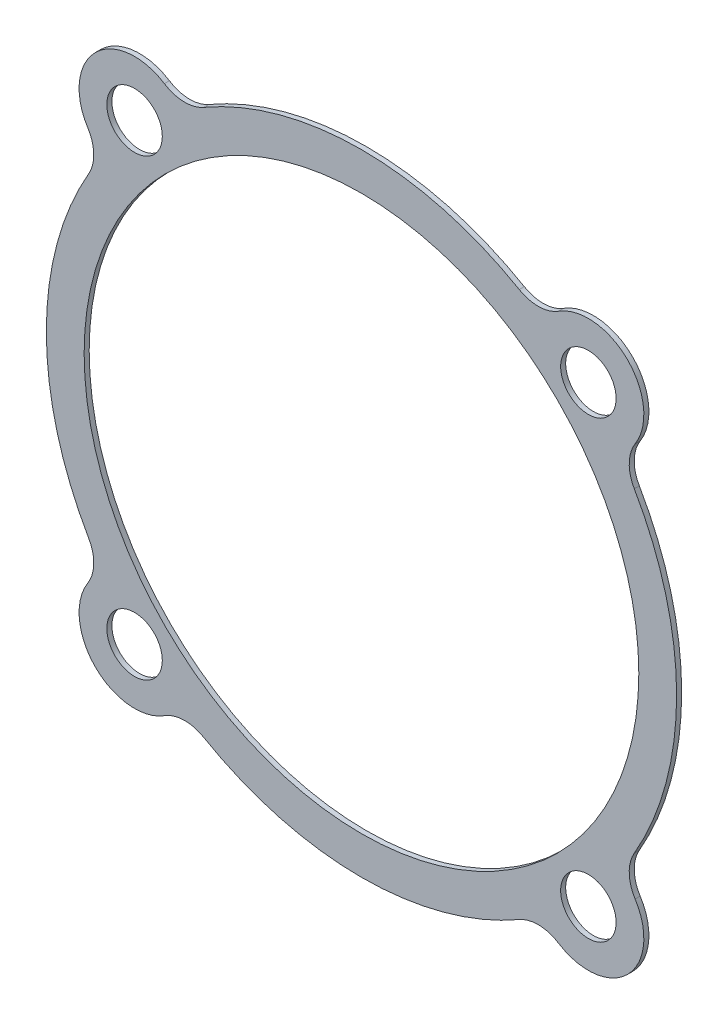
ISO-10303-21;
HEADER;
FILE_DESCRIPTION(('STEP AP214'),'2;1');
FILE_NAME('part.step','',(''),(''),'','','');
FILE_SCHEMA(('AUTOMOTIVE_DESIGN { 1 0 10303 214 1 1 1 1 }'));
ENDSEC;
DATA;
#1=APPLICATION_CONTEXT('core data for automotive mechanical design processes');
#2=APPLICATION_PROTOCOL_DEFINITION('international standard','automotive_design',2000,#1);
#3=PRODUCT_CONTEXT('',#1,'mechanical');
#4=PRODUCT('Part','Part','',(#3));
#5=PRODUCT_RELATED_PRODUCT_CATEGORY('part','',(#4));
#6=PRODUCT_DEFINITION_FORMATION('','',#4);
#7=PRODUCT_DEFINITION_CONTEXT('part definition',#1,'design');
#8=PRODUCT_DEFINITION('design','',#6,#7);
#9=PRODUCT_DEFINITION_SHAPE('','',#8);
#10=(LENGTH_UNIT() NAMED_UNIT(*) SI_UNIT(.MILLI.,.METRE.));
#11=(NAMED_UNIT(*) PLANE_ANGLE_UNIT() SI_UNIT($,.RADIAN.));
#12=(NAMED_UNIT(*) SI_UNIT($,.STERADIAN.) SOLID_ANGLE_UNIT());
#13=UNCERTAINTY_MEASURE_WITH_UNIT(LENGTH_MEASURE(1.E-05),#10,'distance_accuracy_value','');
#14=(GEOMETRIC_REPRESENTATION_CONTEXT(3) GLOBAL_UNCERTAINTY_ASSIGNED_CONTEXT((#13)) GLOBAL_UNIT_ASSIGNED_CONTEXT((#10,
#11,#12)) REPRESENTATION_CONTEXT('',''));
#15=CARTESIAN_POINT('',(0.,0.,0.));
#16=DIRECTION('',(0.,0.,1.));
#17=DIRECTION('',(1.,0.,0.));
#18=AXIS2_PLACEMENT_3D('',#15,#16,#17);
#19=CARTESIAN_POINT('',(-12.118910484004,7.0094228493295,0.));
#20=DIRECTION('',(0.,0.,-1.));
#21=DIRECTION('',(-1.,0.,0.));
#22=AXIS2_PLACEMENT_3D('',#19,#20,#21);
#23=CYLINDRICAL_SURFACE('',#22,1.49999999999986);
#24=CARTESIAN_POINT('',(-12.118910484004,7.0094228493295,-0.2));
#25=DIRECTION('',(0.,0.,1.));
#26=DIRECTION('',(1.,0.,0.));
#27=AXIS2_PLACEMENT_3D('',#24,#25,#26);
#28=CIRCLE('',#27,1.49999999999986);
#29=CARTESIAN_POINT('',(-10.8204557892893,6.25841325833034,-0.2));
#30=VERTEX_POINT('',#29);
#31=CARTESIAN_POINT('',(-10.8544873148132,7.81641358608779,-0.2));
#32=VERTEX_POINT('',#31);
#33=EDGE_CURVE('E462',#30,#32,#28,.T.);
#34=ORIENTED_EDGE('',*,*,#33,.F.);
#35=DIRECTION('',(0.,0.,-1.));
#36=VECTOR('',#35,1.);
#37=CARTESIAN_POINT('',(-10.8204557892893,6.25841325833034,0.));
#38=LINE('',#37,#36);
#39=CARTESIAN_POINT('',(-10.8204557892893,6.25841325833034,0.));
#40=VERTEX_POINT('',#39);
#41=EDGE_CURVE('E11',#40,#30,#38,.T.);
#42=ORIENTED_EDGE('',*,*,#41,.F.);
#43=CARTESIAN_POINT('',(-12.118910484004,7.0094228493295,0.));
#44=DIRECTION('',(0.,0.,1.));
#45=DIRECTION('',(1.,0.,0.));
#46=AXIS2_PLACEMENT_3D('',#43,#44,#45);
#47=CIRCLE('',#46,1.49999999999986);
#48=CARTESIAN_POINT('',(-10.8544873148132,7.81641358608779,0.));
#49=VERTEX_POINT('',#48);
#50=EDGE_CURVE('E464',#40,#49,#47,.T.);
#51=ORIENTED_EDGE('',*,*,#50,.T.);
#52=DIRECTION('',(0.,0.,-1.));
#53=VECTOR('',#52,1.);
#54=CARTESIAN_POINT('',(-10.8544873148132,7.81641358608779,0.));
#55=LINE('',#54,#53);
#56=EDGE_CURVE('E353',#49,#32,#55,.T.);
#57=ORIENTED_EDGE('',*,*,#56,.T.);
#58=EDGE_LOOP('',(#34,#42,#51,#57));
#59=FACE_BOUND('',#58,.T.);
#60=ADVANCED_FACE('F350',(#59),#23,.F.);
#61=CARTESIAN_POINT('',(0.,0.,0.));
#62=DIRECTION('',(0.,0.,-1.));
#63=DIRECTION('',(-1.,0.,0.));
#64=AXIS2_PLACEMENT_3D('',#61,#62,#63);
#65=CYLINDRICAL_SURFACE('',#64,12.5000000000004);
#66=CARTESIAN_POINT('',(0.,0.,-0.2));
#67=DIRECTION('',(0.,0.,-1.));
#68=DIRECTION('',(-1.,0.,0.));
#69=AXIS2_PLACEMENT_3D('',#66,#67,#68);
#70=CIRCLE('',#69,12.5000000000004);
#71=CARTESIAN_POINT('',(-10.8204557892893,-6.25841325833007,-0.2));
#72=VERTEX_POINT('',#71);
#73=EDGE_CURVE('E480',#72,#30,#70,.T.);
#74=ORIENTED_EDGE('',*,*,#73,.F.);
#75=DIRECTION('',(0.,0.,-1.));
#76=VECTOR('',#75,1.);
#77=CARTESIAN_POINT('',(-10.8204557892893,-6.25841325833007,0.));
#78=LINE('',#77,#76);
#79=CARTESIAN_POINT('',(-10.8204557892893,-6.25841325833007,0.));
#80=VERTEX_POINT('',#79);
#81=EDGE_CURVE('E358',#80,#72,#78,.T.);
#82=ORIENTED_EDGE('',*,*,#81,.F.);
#83=CARTESIAN_POINT('',(0.,0.,0.));
#84=DIRECTION('',(0.,0.,-1.));
#85=DIRECTION('',(-1.,0.,0.));
#86=AXIS2_PLACEMENT_3D('',#83,#84,#85);
#87=CIRCLE('',#86,12.5000000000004);
#88=EDGE_CURVE('E469',#80,#40,#87,.T.);
#89=ORIENTED_EDGE('',*,*,#88,.T.);
#90=ORIENTED_EDGE('',*,*,#41,.T.);
#91=EDGE_LOOP('',(#74,#82,#89,#90));
#92=FACE_BOUND('',#91,.T.);
#93=ADVANCED_FACE('F645',(#92),#65,.T.);
#94=CARTESIAN_POINT('',(-12.118910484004,-7.0094228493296,0.));
#95=DIRECTION('',(0.,0.,-1.));
#96=DIRECTION('',(-1.,0.,0.));
#97=AXIS2_PLACEMENT_3D('',#94,#95,#96);
#98=CYLINDRICAL_SURFACE('',#97,1.49999999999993);
#99=CARTESIAN_POINT('',(-12.118910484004,-7.0094228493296,-0.2));
#100=DIRECTION('',(0.,0.,1.));
#101=DIRECTION('',(1.,0.,0.));
#102=AXIS2_PLACEMENT_3D('',#99,#100,#101);
#103=CIRCLE('',#102,1.49999999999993);
#104=CARTESIAN_POINT('',(-10.8544873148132,-7.81641358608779,-0.2));
#105=VERTEX_POINT('',#104);
#106=EDGE_CURVE('E522',#105,#72,#103,.T.);
#107=ORIENTED_EDGE('',*,*,#106,.F.);
#108=DIRECTION('',(0.,0.,-1.));
#109=VECTOR('',#108,1.);
#110=CARTESIAN_POINT('',(-10.8544873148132,-7.81641358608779,0.));
#111=LINE('',#110,#109);
#112=CARTESIAN_POINT('',(-10.8544873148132,-7.81641358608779,0.));
#113=VERTEX_POINT('',#112);
#114=EDGE_CURVE('E568',#113,#105,#111,.T.);
#115=ORIENTED_EDGE('',*,*,#114,.F.);
#116=CARTESIAN_POINT('',(-12.118910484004,-7.0094228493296,0.));
#117=DIRECTION('',(0.,0.,1.));
#118=DIRECTION('',(1.,0.,0.));
#119=AXIS2_PLACEMENT_3D('',#116,#117,#118);
#120=CIRCLE('',#119,1.49999999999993);
#121=EDGE_CURVE('E564',#113,#80,#120,.T.);
#122=ORIENTED_EDGE('',*,*,#121,.T.);
#123=ORIENTED_EDGE('',*,*,#81,.T.);
#124=EDGE_LOOP('',(#107,#115,#122,#123));
#125=FACE_BOUND('',#124,.T.);
#126=ADVANCED_FACE('F641',(#125),#98,.F.);
#127=CARTESIAN_POINT('',(-9.,-9.,0.));
#128=DIRECTION('',(0.,0.,-1.));
#129=DIRECTION('',(-1.,0.,0.));
#130=AXIS2_PLACEMENT_3D('',#127,#128,#129);
#131=CYLINDRICAL_SURFACE('',#130,2.20000000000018);
#132=CARTESIAN_POINT('',(-9.,-9.,-0.2));
#133=DIRECTION('',(0.,0.,-1.));
#134=DIRECTION('',(-1.,0.,0.));
#135=AXIS2_PLACEMENT_3D('',#132,#133,#134);
#136=CIRCLE('',#135,2.20000000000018);
#137=CARTESIAN_POINT('',(-7.81641358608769,-10.8544873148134,-0.2));
#138=VERTEX_POINT('',#137);
#139=EDGE_CURVE('E519',#138,#105,#136,.T.);
#140=ORIENTED_EDGE('',*,*,#139,.F.);
#141=DIRECTION('',(0.,0.,-1.));
#142=VECTOR('',#141,1.);
#143=CARTESIAN_POINT('',(-7.81641358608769,-10.8544873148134,0.));
#144=LINE('',#143,#142);
#145=CARTESIAN_POINT('',(-7.81641358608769,-10.8544873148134,0.));
#146=VERTEX_POINT('',#145);
#147=EDGE_CURVE('E570',#146,#138,#144,.T.);
#148=ORIENTED_EDGE('',*,*,#147,.F.);
#149=CARTESIAN_POINT('',(-9.,-9.,0.));
#150=DIRECTION('',(0.,0.,-1.));
#151=DIRECTION('',(-1.,0.,0.));
#152=AXIS2_PLACEMENT_3D('',#149,#150,#151);
#153=CIRCLE('',#152,2.20000000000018);
#154=EDGE_CURVE('E561',#146,#113,#153,.T.);
#155=ORIENTED_EDGE('',*,*,#154,.T.);
#156=ORIENTED_EDGE('',*,*,#114,.T.);
#157=EDGE_LOOP('',(#140,#148,#155,#156));
#158=FACE_BOUND('',#157,.T.);
#159=ADVANCED_FACE('F637',(#158),#131,.T.);
#160=CARTESIAN_POINT('',(-7.0094228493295,-12.118910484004,0.));
#161=DIRECTION('',(0.,0.,-1.));
#162=DIRECTION('',(-1.,0.,0.));
#163=AXIS2_PLACEMENT_3D('',#160,#161,#162);
#164=CYLINDRICAL_SURFACE('',#163,1.49999999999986);
#165=CARTESIAN_POINT('',(-7.0094228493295,-12.118910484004,-0.2));
#166=DIRECTION('',(0.,0.,1.));
#167=DIRECTION('',(1.,0.,0.));
#168=AXIS2_PLACEMENT_3D('',#165,#166,#167);
#169=CIRCLE('',#168,1.49999999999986);
#170=CARTESIAN_POINT('',(-6.25841325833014,-10.8204557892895,-0.2));
#171=VERTEX_POINT('',#170);
#172=EDGE_CURVE('E516',#171,#138,#169,.T.);
#173=ORIENTED_EDGE('',*,*,#172,.F.);
#174=DIRECTION('',(0.,0.,-1.));
#175=VECTOR('',#174,1.);
#176=CARTESIAN_POINT('',(-6.25841325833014,-10.8204557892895,0.));
#177=LINE('',#176,#175);
#178=CARTESIAN_POINT('',(-6.25841325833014,-10.8204557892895,0.));
#179=VERTEX_POINT('',#178);
#180=EDGE_CURVE('E572',#179,#171,#177,.T.);
#181=ORIENTED_EDGE('',*,*,#180,.F.);
#182=CARTESIAN_POINT('',(-7.0094228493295,-12.118910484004,0.));
#183=DIRECTION('',(0.,0.,1.));
#184=DIRECTION('',(1.,0.,0.));
#185=AXIS2_PLACEMENT_3D('',#182,#183,#184);
#186=CIRCLE('',#185,1.49999999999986);
#187=EDGE_CURVE('E558',#179,#146,#186,.T.);
#188=ORIENTED_EDGE('',*,*,#187,.T.);
#189=ORIENTED_EDGE('',*,*,#147,.T.);
#190=EDGE_LOOP('',(#173,#181,#188,#189));
#191=FACE_BOUND('',#190,.T.);
#192=ADVANCED_FACE('F633',(#191),#164,.F.);
#193=CARTESIAN_POINT('',(0.,0.,0.));
#194=DIRECTION('',(0.,0.,-1.));
#195=DIRECTION('',(-1.,0.,0.));
#196=AXIS2_PLACEMENT_3D('',#193,#194,#195);
#197=CYLINDRICAL_SURFACE('',#196,12.5000000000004);
#198=CARTESIAN_POINT('',(0.,0.,-0.2));
#199=DIRECTION('',(0.,0.,-1.));
#200=DIRECTION('',(-1.,0.,0.));
#201=AXIS2_PLACEMENT_3D('',#198,#199,#200);
#202=CIRCLE('',#201,12.5000000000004);
#203=CARTESIAN_POINT('',(6.25841325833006,-10.8204557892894,-0.2));
#204=VERTEX_POINT('',#203);
#205=EDGE_CURVE('E513',#204,#171,#202,.T.);
#206=ORIENTED_EDGE('',*,*,#205,.F.);
#207=DIRECTION('',(0.,0.,-1.));
#208=VECTOR('',#207,1.);
#209=CARTESIAN_POINT('',(6.25841325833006,-10.8204557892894,0.));
#210=LINE('',#209,#208);
#211=CARTESIAN_POINT('',(6.25841325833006,-10.8204557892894,0.));
#212=VERTEX_POINT('',#211);
#213=EDGE_CURVE('E574',#212,#204,#210,.T.);
#214=ORIENTED_EDGE('',*,*,#213,.F.);
#215=CARTESIAN_POINT('',(0.,0.,0.));
#216=DIRECTION('',(0.,0.,-1.));
#217=DIRECTION('',(-1.,0.,0.));
#218=AXIS2_PLACEMENT_3D('',#215,#216,#217);
#219=CIRCLE('',#218,12.5000000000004);
#220=EDGE_CURVE('E555',#212,#179,#219,.T.);
#221=ORIENTED_EDGE('',*,*,#220,.T.);
#222=ORIENTED_EDGE('',*,*,#180,.T.);
#223=EDGE_LOOP('',(#206,#214,#221,#222));
#224=FACE_BOUND('',#223,.T.);
#225=ADVANCED_FACE('F629',(#224),#197,.T.);
#226=CARTESIAN_POINT('',(7.0094228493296,-12.118910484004,0.));
#227=DIRECTION('',(0.,0.,-1.));
#228=DIRECTION('',(-1.,0.,0.));
#229=AXIS2_PLACEMENT_3D('',#226,#227,#228);
#230=CYLINDRICAL_SURFACE('',#229,1.49999999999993);
#231=CARTESIAN_POINT('',(7.0094228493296,-12.118910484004,-0.2));
#232=DIRECTION('',(0.,0.,1.));
#233=DIRECTION('',(1.,0.,0.));
#234=AXIS2_PLACEMENT_3D('',#231,#232,#233);
#235=CIRCLE('',#234,1.49999999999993);
#236=CARTESIAN_POINT('',(7.81641358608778,-10.8544873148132,-0.2));
#237=VERTEX_POINT('',#236);
#238=EDGE_CURVE('E510',#237,#204,#235,.T.);
#239=ORIENTED_EDGE('',*,*,#238,.F.);
#240=DIRECTION('',(0.,0.,-1.));
#241=VECTOR('',#240,1.);
#242=CARTESIAN_POINT('',(7.81641358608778,-10.8544873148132,0.));
#243=LINE('',#242,#241);
#244=CARTESIAN_POINT('',(7.81641358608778,-10.8544873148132,0.));
#245=VERTEX_POINT('',#244);
#246=EDGE_CURVE('E576',#245,#237,#243,.T.);
#247=ORIENTED_EDGE('',*,*,#246,.F.);
#248=CARTESIAN_POINT('',(7.0094228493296,-12.118910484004,0.));
#249=DIRECTION('',(0.,0.,1.));
#250=DIRECTION('',(1.,0.,0.));
#251=AXIS2_PLACEMENT_3D('',#248,#249,#250);
#252=CIRCLE('',#251,1.49999999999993);
#253=EDGE_CURVE('E552',#245,#212,#252,.T.);
#254=ORIENTED_EDGE('',*,*,#253,.T.);
#255=ORIENTED_EDGE('',*,*,#213,.T.);
#256=EDGE_LOOP('',(#239,#247,#254,#255));
#257=FACE_BOUND('',#256,.T.);
#258=ADVANCED_FACE('F625',(#257),#230,.F.);
#259=CARTESIAN_POINT('',(9.,-9.,0.));
#260=DIRECTION('',(0.,0.,-1.));
#261=DIRECTION('',(-1.,0.,0.));
#262=AXIS2_PLACEMENT_3D('',#259,#260,#261);
#263=CYLINDRICAL_SURFACE('',#262,2.20000000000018);
#264=CARTESIAN_POINT('',(9.,-9.,-0.2));
#265=DIRECTION('',(0.,0.,-1.));
#266=DIRECTION('',(-1.,0.,0.));
#267=AXIS2_PLACEMENT_3D('',#264,#265,#266);
#268=CIRCLE('',#267,2.20000000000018);
#269=CARTESIAN_POINT('',(10.8544873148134,-7.81641358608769,-0.2));
#270=VERTEX_POINT('',#269);
#271=EDGE_CURVE('E507',#270,#237,#268,.T.);
#272=ORIENTED_EDGE('',*,*,#271,.F.);
#273=DIRECTION('',(0.,0.,-1.));
#274=VECTOR('',#273,1.);
#275=CARTESIAN_POINT('',(10.8544873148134,-7.81641358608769,0.));
#276=LINE('',#275,#274);
#277=CARTESIAN_POINT('',(10.8544873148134,-7.81641358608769,0.));
#278=VERTEX_POINT('',#277);
#279=EDGE_CURVE('E578',#278,#270,#276,.T.);
#280=ORIENTED_EDGE('',*,*,#279,.F.);
#281=CARTESIAN_POINT('',(9.,-9.,0.));
#282=DIRECTION('',(0.,0.,-1.));
#283=DIRECTION('',(-1.,0.,0.));
#284=AXIS2_PLACEMENT_3D('',#281,#282,#283);
#285=CIRCLE('',#284,2.20000000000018);
#286=EDGE_CURVE('E549',#278,#245,#285,.T.);
#287=ORIENTED_EDGE('',*,*,#286,.T.);
#288=ORIENTED_EDGE('',*,*,#246,.T.);
#289=EDGE_LOOP('',(#272,#280,#287,#288));
#290=FACE_BOUND('',#289,.T.);
#291=ADVANCED_FACE('F621',(#290),#263,.T.);
#292=CARTESIAN_POINT('',(12.118910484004,-7.0094228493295,0.));
#293=DIRECTION('',(0.,0.,-1.));
#294=DIRECTION('',(-1.,0.,0.));
#295=AXIS2_PLACEMENT_3D('',#292,#293,#294);
#296=CYLINDRICAL_SURFACE('',#295,1.49999999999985);
#297=CARTESIAN_POINT('',(12.118910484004,-7.0094228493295,-0.2));
#298=DIRECTION('',(0.,0.,1.));
#299=DIRECTION('',(1.,0.,0.));
#300=AXIS2_PLACEMENT_3D('',#297,#298,#299);
#301=CIRCLE('',#300,1.49999999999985);
#302=CARTESIAN_POINT('',(10.8204557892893,-6.25841325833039,-0.2));
#303=VERTEX_POINT('',#302);
#304=EDGE_CURVE('E504',#303,#270,#301,.T.);
#305=ORIENTED_EDGE('',*,*,#304,.F.);
#306=DIRECTION('',(0.,0.,-1.));
#307=VECTOR('',#306,1.);
#308=CARTESIAN_POINT('',(10.8204557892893,-6.25841325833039,0.));
#309=LINE('',#308,#307);
#310=CARTESIAN_POINT('',(10.8204557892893,-6.25841325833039,0.));
#311=VERTEX_POINT('',#310);
#312=EDGE_CURVE('E580',#311,#303,#309,.T.);
#313=ORIENTED_EDGE('',*,*,#312,.F.);
#314=CARTESIAN_POINT('',(12.118910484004,-7.0094228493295,0.));
#315=DIRECTION('',(0.,0.,1.));
#316=DIRECTION('',(1.,0.,0.));
#317=AXIS2_PLACEMENT_3D('',#314,#315,#316);
#318=CIRCLE('',#317,1.49999999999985);
#319=EDGE_CURVE('E546',#311,#278,#318,.T.);
#320=ORIENTED_EDGE('',*,*,#319,.T.);
#321=ORIENTED_EDGE('',*,*,#279,.T.);
#322=EDGE_LOOP('',(#305,#313,#320,#321));
#323=FACE_BOUND('',#322,.T.);
#324=ADVANCED_FACE('F617',(#323),#296,.F.);
#325=CARTESIAN_POINT('',(0.,0.,0.));
#326=DIRECTION('',(0.,0.,-1.));
#327=DIRECTION('',(-1.,0.,0.));
#328=AXIS2_PLACEMENT_3D('',#325,#326,#327);
#329=CYLINDRICAL_SURFACE('',#328,12.5000000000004);
#330=CARTESIAN_POINT('',(0.,0.,-0.2));
#331=DIRECTION('',(0.,0.,-1.));
#332=DIRECTION('',(-1.,0.,0.));
#333=AXIS2_PLACEMENT_3D('',#330,#331,#332);
#334=CIRCLE('',#333,12.5000000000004);
#335=CARTESIAN_POINT('',(10.8204557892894,6.2584132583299,-0.2));
#336=VERTEX_POINT('',#335);
#337=EDGE_CURVE('E501',#336,#303,#334,.T.);
#338=ORIENTED_EDGE('',*,*,#337,.F.);
#339=DIRECTION('',(0.,0.,-1.));
#340=VECTOR('',#339,1.);
#341=CARTESIAN_POINT('',(10.8204557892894,6.2584132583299,0.));
#342=LINE('',#341,#340);
#343=CARTESIAN_POINT('',(10.8204557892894,6.2584132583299,0.));
#344=VERTEX_POINT('',#343);
#345=EDGE_CURVE('E582',#344,#336,#342,.T.);
#346=ORIENTED_EDGE('',*,*,#345,.F.);
#347=CARTESIAN_POINT('',(0.,0.,0.));
#348=DIRECTION('',(0.,0.,-1.));
#349=DIRECTION('',(-1.,0.,0.));
#350=AXIS2_PLACEMENT_3D('',#347,#348,#349);
#351=CIRCLE('',#350,12.5000000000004);
#352=EDGE_CURVE('E543',#344,#311,#351,.T.);
#353=ORIENTED_EDGE('',*,*,#352,.T.);
#354=ORIENTED_EDGE('',*,*,#312,.T.);
#355=EDGE_LOOP('',(#338,#346,#353,#354));
#356=FACE_BOUND('',#355,.T.);
#357=ADVANCED_FACE('F613',(#356),#329,.T.);
#358=CARTESIAN_POINT('',(12.118910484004,7.0094228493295,0.));
#359=DIRECTION('',(0.,0.,-1.));
#360=DIRECTION('',(-1.,0.,0.));
#361=AXIS2_PLACEMENT_3D('',#358,#359,#360);
#362=CYLINDRICAL_SURFACE('',#361,1.49999999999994);
#363=CARTESIAN_POINT('',(12.118910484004,7.0094228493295,-0.2));
#364=DIRECTION('',(0.,0.,1.));
#365=DIRECTION('',(1.,0.,0.));
#366=AXIS2_PLACEMENT_3D('',#363,#364,#365);
#367=CIRCLE('',#366,1.49999999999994);
#368=CARTESIAN_POINT('',(10.8544873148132,7.81641358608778,-0.2));
#369=VERTEX_POINT('',#368);
#370=EDGE_CURVE('E498',#369,#336,#367,.T.);
#371=ORIENTED_EDGE('',*,*,#370,.F.);
#372=DIRECTION('',(0.,0.,-1.));
#373=VECTOR('',#372,1.);
#374=CARTESIAN_POINT('',(10.8544873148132,7.81641358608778,0.));
#375=LINE('',#374,#373);
#376=CARTESIAN_POINT('',(10.8544873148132,7.81641358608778,0.));
#377=VERTEX_POINT('',#376);
#378=EDGE_CURVE('E584',#377,#369,#375,.T.);
#379=ORIENTED_EDGE('',*,*,#378,.F.);
#380=CARTESIAN_POINT('',(12.118910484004,7.0094228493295,0.));
#381=DIRECTION('',(0.,0.,1.));
#382=DIRECTION('',(1.,0.,0.));
#383=AXIS2_PLACEMENT_3D('',#380,#381,#382);
#384=CIRCLE('',#383,1.49999999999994);
#385=EDGE_CURVE('E540',#377,#344,#384,.T.);
#386=ORIENTED_EDGE('',*,*,#385,.T.);
#387=ORIENTED_EDGE('',*,*,#345,.T.);
#388=EDGE_LOOP('',(#371,#379,#386,#387));
#389=FACE_BOUND('',#388,.T.);
#390=ADVANCED_FACE('F609',(#389),#362,.F.);
#391=CARTESIAN_POINT('',(9.,9.,0.));
#392=DIRECTION('',(0.,0.,-1.));
#393=DIRECTION('',(-1.,0.,0.));
#394=AXIS2_PLACEMENT_3D('',#391,#392,#393);
#395=CYLINDRICAL_SURFACE('',#394,2.20000000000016);
#396=CARTESIAN_POINT('',(9.,9.,-0.2));
#397=DIRECTION('',(0.,0.,-1.));
#398=DIRECTION('',(-1.,0.,0.));
#399=AXIS2_PLACEMENT_3D('',#396,#397,#398);
#400=CIRCLE('',#399,2.20000000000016);
#401=CARTESIAN_POINT('',(7.81641358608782,10.8544873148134,-0.2));
#402=VERTEX_POINT('',#401);
#403=EDGE_CURVE('E495',#402,#369,#400,.T.);
#404=ORIENTED_EDGE('',*,*,#403,.F.);
#405=DIRECTION('',(0.,0.,-1.));
#406=VECTOR('',#405,1.);
#407=CARTESIAN_POINT('',(7.81641358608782,10.8544873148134,0.));
#408=LINE('',#407,#406);
#409=CARTESIAN_POINT('',(7.81641358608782,10.8544873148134,0.));
#410=VERTEX_POINT('',#409);
#411=EDGE_CURVE('E586',#410,#402,#408,.T.);
#412=ORIENTED_EDGE('',*,*,#411,.F.);
#413=CARTESIAN_POINT('',(9.,9.,0.));
#414=DIRECTION('',(0.,0.,-1.));
#415=DIRECTION('',(-1.,0.,0.));
#416=AXIS2_PLACEMENT_3D('',#413,#414,#415);
#417=CIRCLE('',#416,2.20000000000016);
#418=EDGE_CURVE('E537',#410,#377,#417,.T.);
#419=ORIENTED_EDGE('',*,*,#418,.T.);
#420=ORIENTED_EDGE('',*,*,#378,.T.);
#421=EDGE_LOOP('',(#404,#412,#419,#420));
#422=FACE_BOUND('',#421,.T.);
#423=ADVANCED_FACE('F605',(#422),#395,.T.);
#424=CARTESIAN_POINT('',(7.0094228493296,12.118910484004,0.));
#425=DIRECTION('',(0.,0.,-1.));
#426=DIRECTION('',(-1.,0.,0.));
#427=AXIS2_PLACEMENT_3D('',#424,#425,#426);
#428=CYLINDRICAL_SURFACE('',#427,1.49999999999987);
#429=CARTESIAN_POINT('',(7.0094228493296,12.118910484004,-0.2));
#430=DIRECTION('',(0.,0.,1.));
#431=DIRECTION('',(1.,0.,0.));
#432=AXIS2_PLACEMENT_3D('',#429,#430,#431);
#433=CIRCLE('',#432,1.49999999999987);
#434=CARTESIAN_POINT('',(6.2584132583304,10.8204557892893,-0.2));
#435=VERTEX_POINT('',#434);
#436=EDGE_CURVE('E492',#435,#402,#433,.T.);
#437=ORIENTED_EDGE('',*,*,#436,.F.);
#438=DIRECTION('',(0.,0.,-1.));
#439=VECTOR('',#438,1.);
#440=CARTESIAN_POINT('',(6.2584132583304,10.8204557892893,0.));
#441=LINE('',#440,#439);
#442=CARTESIAN_POINT('',(6.2584132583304,10.8204557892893,0.));
#443=VERTEX_POINT('',#442);
#444=EDGE_CURVE('E588',#443,#435,#441,.T.);
#445=ORIENTED_EDGE('',*,*,#444,.F.);
#446=CARTESIAN_POINT('',(7.0094228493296,12.118910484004,0.));
#447=DIRECTION('',(0.,0.,1.));
#448=DIRECTION('',(1.,0.,0.));
#449=AXIS2_PLACEMENT_3D('',#446,#447,#448);
#450=CIRCLE('',#449,1.49999999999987);
#451=EDGE_CURVE('E534',#443,#410,#450,.T.);
#452=ORIENTED_EDGE('',*,*,#451,.T.);
#453=ORIENTED_EDGE('',*,*,#411,.T.);
#454=EDGE_LOOP('',(#437,#445,#452,#453));
#455=FACE_BOUND('',#454,.T.);
#456=ADVANCED_FACE('F601',(#455),#428,.F.);
#457=CARTESIAN_POINT('',(0.,0.,0.));
#458=DIRECTION('',(0.,0.,-1.));
#459=DIRECTION('',(-1.,0.,0.));
#460=AXIS2_PLACEMENT_3D('',#457,#458,#459);
#461=CYLINDRICAL_SURFACE('',#460,12.5000000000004);
#462=CARTESIAN_POINT('',(0.,0.,-0.2));
#463=DIRECTION('',(0.,0.,-1.));
#464=DIRECTION('',(-1.,0.,0.));
#465=AXIS2_PLACEMENT_3D('',#462,#463,#464);
#466=CIRCLE('',#465,12.5000000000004);
#467=CARTESIAN_POINT('',(-6.25841325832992,10.8204557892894,-0.2));
#468=VERTEX_POINT('',#467);
#469=EDGE_CURVE('E489',#468,#435,#466,.T.);
#470=ORIENTED_EDGE('',*,*,#469,.F.);
#471=DIRECTION('',(0.,0.,-1.));
#472=VECTOR('',#471,1.);
#473=CARTESIAN_POINT('',(-6.25841325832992,10.8204557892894,0.));
#474=LINE('',#473,#472);
#475=CARTESIAN_POINT('',(-6.25841325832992,10.8204557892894,0.));
#476=VERTEX_POINT('',#475);
#477=EDGE_CURVE('E590',#476,#468,#474,.T.);
#478=ORIENTED_EDGE('',*,*,#477,.F.);
#479=CARTESIAN_POINT('',(0.,0.,0.));
#480=DIRECTION('',(0.,0.,-1.));
#481=DIRECTION('',(-1.,0.,0.));
#482=AXIS2_PLACEMENT_3D('',#479,#480,#481);
#483=CIRCLE('',#482,12.5000000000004);
#484=EDGE_CURVE('E531',#476,#443,#483,.T.);
#485=ORIENTED_EDGE('',*,*,#484,.T.);
#486=ORIENTED_EDGE('',*,*,#444,.T.);
#487=EDGE_LOOP('',(#470,#478,#485,#486));
#488=FACE_BOUND('',#487,.T.);
#489=ADVANCED_FACE('F597',(#488),#461,.T.);
#490=CARTESIAN_POINT('',(-7.0094228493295,12.118910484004,0.));
#491=DIRECTION('',(0.,0.,-1.));
#492=DIRECTION('',(-1.,0.,0.));
#493=AXIS2_PLACEMENT_3D('',#490,#491,#492);
#494=CYLINDRICAL_SURFACE('',#493,1.49999999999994);
#495=CARTESIAN_POINT('',(-7.0094228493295,12.118910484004,-0.2));
#496=DIRECTION('',(0.,0.,1.));
#497=DIRECTION('',(1.,0.,0.));
#498=AXIS2_PLACEMENT_3D('',#495,#496,#497);
#499=CIRCLE('',#498,1.49999999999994);
#500=CARTESIAN_POINT('',(-7.81641358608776,10.8544873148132,-0.2));
#501=VERTEX_POINT('',#500);
#502=EDGE_CURVE('E476',#501,#468,#499,.T.);
#503=ORIENTED_EDGE('',*,*,#502,.F.);
#504=DIRECTION('',(0.,0.,-1.));
#505=VECTOR('',#504,1.);
#506=CARTESIAN_POINT('',(-7.81641358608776,10.8544873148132,0.));
#507=LINE('',#506,#505);
#508=CARTESIAN_POINT('',(-7.81641358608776,10.8544873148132,0.));
#509=VERTEX_POINT('',#508);
#510=EDGE_CURVE('E468',#509,#501,#507,.T.);
#511=ORIENTED_EDGE('',*,*,#510,.F.);
#512=CARTESIAN_POINT('',(-7.0094228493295,12.118910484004,0.));
#513=DIRECTION('',(0.,0.,1.));
#514=DIRECTION('',(1.,0.,0.));
#515=AXIS2_PLACEMENT_3D('',#512,#513,#514);
#516=CIRCLE('',#515,1.49999999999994);
#517=EDGE_CURVE('E528',#509,#476,#516,.T.);
#518=ORIENTED_EDGE('',*,*,#517,.T.);
#519=ORIENTED_EDGE('',*,*,#477,.T.);
#520=EDGE_LOOP('',(#503,#511,#518,#519));
#521=FACE_BOUND('',#520,.T.);
#522=ADVANCED_FACE('F593',(#521),#494,.F.);
#523=CARTESIAN_POINT('',(-9.,9.,0.));
#524=DIRECTION('',(0.,0.,-1.));
#525=DIRECTION('',(-1.,0.,0.));
#526=AXIS2_PLACEMENT_3D('',#523,#524,#525);
#527=CYLINDRICAL_SURFACE('',#526,2.20000000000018);
#528=CARTESIAN_POINT('',(-9.,9.,-0.2));
#529=DIRECTION('',(0.,0.,-1.));
#530=DIRECTION('',(-1.,0.,0.));
#531=AXIS2_PLACEMENT_3D('',#528,#529,#530);
#532=CIRCLE('',#531,2.20000000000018);
#533=EDGE_CURVE('E471',#32,#501,#532,.T.);
#534=ORIENTED_EDGE('',*,*,#533,.F.);
#535=ORIENTED_EDGE('',*,*,#56,.F.);
#536=CARTESIAN_POINT('',(-9.,9.,0.));
#537=DIRECTION('',(0.,0.,-1.));
#538=DIRECTION('',(-1.,0.,0.));
#539=AXIS2_PLACEMENT_3D('',#536,#537,#538);
#540=CIRCLE('',#539,2.20000000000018);
#541=EDGE_CURVE('E526',#49,#509,#540,.T.);
#542=ORIENTED_EDGE('',*,*,#541,.T.);
#543=ORIENTED_EDGE('',*,*,#510,.T.);
#544=EDGE_LOOP('',(#534,#535,#542,#543));
#545=FACE_BOUND('',#544,.T.);
#546=ADVANCED_FACE('F472',(#545),#527,.T.);
#547=CARTESIAN_POINT('',(-10.559455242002,8.00471142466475,0.));
#548=DIRECTION('',(0.,0.,1.));
#549=DIRECTION('',(1.,0.,0.));
#550=AXIS2_PLACEMENT_3D('',#547,#548,#549);
#551=PLANE('',#550);
#552=CARTESIAN_POINT('',(0.,0.,0.));
#553=DIRECTION('',(0.,0.,-1.));
#554=DIRECTION('',(1.,0.,0.));
#555=AXIS2_PLACEMENT_3D('',#552,#553,#554);
#556=CIRCLE('',#555,11.);
#557=CARTESIAN_POINT('',(11.,0.,0.));
#558=VERTEX_POINT('',#557);
#559=EDGE_CURVE('E692',#558,#558,#556,.T.);
#560=ORIENTED_EDGE('',*,*,#559,.T.);
#561=EDGE_LOOP('',(#560));
#562=FACE_BOUND('',#561,.T.);
#563=CARTESIAN_POINT('',(9.,9.,0.));
#564=DIRECTION('',(0.,0.,-1.));
#565=DIRECTION('',(1.,0.,0.));
#566=AXIS2_PLACEMENT_3D('',#563,#564,#565);
#567=CIRCLE('',#566,1.10000000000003);
#568=CARTESIAN_POINT('',(10.1,9.,0.));
#569=VERTEX_POINT('',#568);
#570=EDGE_CURVE('E696',#569,#569,#567,.T.);
#571=ORIENTED_EDGE('',*,*,#570,.T.);
#572=EDGE_LOOP('',(#571));
#573=FACE_BOUND('',#572,.T.);
#574=CARTESIAN_POINT('',(-9.,9.,0.));
#575=DIRECTION('',(0.,0.,-1.));
#576=DIRECTION('',(1.,0.,0.));
#577=AXIS2_PLACEMENT_3D('',#574,#575,#576);
#578=CIRCLE('',#577,1.10000000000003);
#579=CARTESIAN_POINT('',(-7.89999999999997,9.,0.));
#580=VERTEX_POINT('',#579);
#581=EDGE_CURVE('E700',#580,#580,#578,.T.);
#582=ORIENTED_EDGE('',*,*,#581,.T.);
#583=EDGE_LOOP('',(#582));
#584=FACE_BOUND('',#583,.T.);
#585=CARTESIAN_POINT('',(9.,-9.,0.));
#586=DIRECTION('',(0.,0.,-1.));
#587=DIRECTION('',(1.,0.,0.));
#588=AXIS2_PLACEMENT_3D('',#585,#586,#587);
#589=CIRCLE('',#588,1.10000000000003);
#590=CARTESIAN_POINT('',(10.1,-9.,0.));
#591=VERTEX_POINT('',#590);
#592=EDGE_CURVE('E704',#591,#591,#589,.T.);
#593=ORIENTED_EDGE('',*,*,#592,.T.);
#594=EDGE_LOOP('',(#593));
#595=FACE_BOUND('',#594,.T.);
#596=CARTESIAN_POINT('',(-9.,-9.,0.));
#597=DIRECTION('',(0.,0.,-1.));
#598=DIRECTION('',(1.,0.,0.));
#599=AXIS2_PLACEMENT_3D('',#596,#597,#598);
#600=CIRCLE('',#599,1.10000000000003);
#601=CARTESIAN_POINT('',(-7.89999999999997,-9.,0.));
#602=VERTEX_POINT('',#601);
#603=EDGE_CURVE('E481',#602,#602,#600,.T.);
#604=ORIENTED_EDGE('',*,*,#603,.T.);
#605=EDGE_LOOP('',(#604));
#606=FACE_BOUND('',#605,.T.);
#607=ORIENTED_EDGE('',*,*,#50,.F.);
#608=ORIENTED_EDGE('',*,*,#88,.F.);
#609=ORIENTED_EDGE('',*,*,#121,.F.);
#610=ORIENTED_EDGE('',*,*,#154,.F.);
#611=ORIENTED_EDGE('',*,*,#187,.F.);
#612=ORIENTED_EDGE('',*,*,#220,.F.);
#613=ORIENTED_EDGE('',*,*,#253,.F.);
#614=ORIENTED_EDGE('',*,*,#286,.F.);
#615=ORIENTED_EDGE('',*,*,#319,.F.);
#616=ORIENTED_EDGE('',*,*,#352,.F.);
#617=ORIENTED_EDGE('',*,*,#385,.F.);
#618=ORIENTED_EDGE('',*,*,#418,.F.);
#619=ORIENTED_EDGE('',*,*,#451,.F.);
#620=ORIENTED_EDGE('',*,*,#484,.F.);
#621=ORIENTED_EDGE('',*,*,#517,.F.);
#622=ORIENTED_EDGE('',*,*,#541,.F.);
#623=EDGE_LOOP('',(#607,#608,#609,#610,#611,#612,#613,#614,#615,#616,#617,#618,#619,#620,#621,#622));
#624=FACE_BOUND('',#623,.T.);
#625=ADVANCED_FACE('F644',(#562,#573,#584,#595,#606,#624),#551,.T.);
#626=CARTESIAN_POINT('',(-10.559455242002,8.00471142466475,-0.2));
#627=DIRECTION('',(0.,0.,1.));
#628=DIRECTION('',(1.,0.,0.));
#629=AXIS2_PLACEMENT_3D('',#626,#627,#628);
#630=PLANE('',#629);
#631=CARTESIAN_POINT('',(0.,0.,-0.2));
#632=DIRECTION('',(0.,0.,-1.));
#633=DIRECTION('',(1.,0.,0.));
#634=AXIS2_PLACEMENT_3D('',#631,#632,#633);
#635=CIRCLE('',#634,11.);
#636=CARTESIAN_POINT('',(11.,0.,-0.2));
#637=VERTEX_POINT('',#636);
#638=EDGE_CURVE('E728',#637,#637,#635,.T.);
#639=ORIENTED_EDGE('',*,*,#638,.F.);
#640=EDGE_LOOP('',(#639));
#641=FACE_BOUND('',#640,.T.);
#642=CARTESIAN_POINT('',(9.,9.,-0.2));
#643=DIRECTION('',(0.,0.,-1.));
#644=DIRECTION('',(1.,0.,0.));
#645=AXIS2_PLACEMENT_3D('',#642,#643,#644);
#646=CIRCLE('',#645,1.10000000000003);
#647=CARTESIAN_POINT('',(10.1,9.,-0.2));
#648=VERTEX_POINT('',#647);
#649=EDGE_CURVE('E724',#648,#648,#646,.T.);
#650=ORIENTED_EDGE('',*,*,#649,.F.);
#651=EDGE_LOOP('',(#650));
#652=FACE_BOUND('',#651,.T.);
#653=CARTESIAN_POINT('',(-9.,9.,-0.2));
#654=DIRECTION('',(0.,0.,-1.));
#655=DIRECTION('',(1.,0.,0.));
#656=AXIS2_PLACEMENT_3D('',#653,#654,#655);
#657=CIRCLE('',#656,1.10000000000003);
#658=CARTESIAN_POINT('',(-7.89999999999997,9.,-0.2));
#659=VERTEX_POINT('',#658);
#660=EDGE_CURVE('E720',#659,#659,#657,.T.);
#661=ORIENTED_EDGE('',*,*,#660,.F.);
#662=EDGE_LOOP('',(#661));
#663=FACE_BOUND('',#662,.T.);
#664=CARTESIAN_POINT('',(9.,-9.,-0.2));
#665=DIRECTION('',(0.,0.,-1.));
#666=DIRECTION('',(1.,0.,0.));
#667=AXIS2_PLACEMENT_3D('',#664,#665,#666);
#668=CIRCLE('',#667,1.10000000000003);
#669=CARTESIAN_POINT('',(10.1,-9.,-0.2));
#670=VERTEX_POINT('',#669);
#671=EDGE_CURVE('E714',#670,#670,#668,.T.);
#672=ORIENTED_EDGE('',*,*,#671,.F.);
#673=EDGE_LOOP('',(#672));
#674=FACE_BOUND('',#673,.T.);
#675=CARTESIAN_POINT('',(-9.,-9.,-0.2));
#676=DIRECTION('',(0.,0.,-1.));
#677=DIRECTION('',(1.,0.,0.));
#678=AXIS2_PLACEMENT_3D('',#675,#676,#677);
#679=CIRCLE('',#678,1.10000000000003);
#680=CARTESIAN_POINT('',(-7.89999999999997,-9.,-0.2));
#681=VERTEX_POINT('',#680);
#682=EDGE_CURVE('E484',#681,#681,#679,.T.);
#683=ORIENTED_EDGE('',*,*,#682,.F.);
#684=EDGE_LOOP('',(#683));
#685=FACE_BOUND('',#684,.T.);
#686=ORIENTED_EDGE('',*,*,#33,.T.);
#687=ORIENTED_EDGE('',*,*,#533,.T.);
#688=ORIENTED_EDGE('',*,*,#502,.T.);
#689=ORIENTED_EDGE('',*,*,#469,.T.);
#690=ORIENTED_EDGE('',*,*,#436,.T.);
#691=ORIENTED_EDGE('',*,*,#403,.T.);
#692=ORIENTED_EDGE('',*,*,#370,.T.);
#693=ORIENTED_EDGE('',*,*,#337,.T.);
#694=ORIENTED_EDGE('',*,*,#304,.T.);
#695=ORIENTED_EDGE('',*,*,#271,.T.);
#696=ORIENTED_EDGE('',*,*,#238,.T.);
#697=ORIENTED_EDGE('',*,*,#205,.T.);
#698=ORIENTED_EDGE('',*,*,#172,.T.);
#699=ORIENTED_EDGE('',*,*,#139,.T.);
#700=ORIENTED_EDGE('',*,*,#106,.T.);
#701=ORIENTED_EDGE('',*,*,#73,.T.);
#702=EDGE_LOOP('',(#686,#687,#688,#689,#690,#691,#692,#693,#694,#695,#696,#697,#698,#699,#700,#701));
#703=FACE_BOUND('',#702,.T.);
#704=ADVANCED_FACE('F478',(#641,#652,#663,#674,#685,#703),#630,.F.);
#705=CARTESIAN_POINT('',(-9.,-9.,0.));
#706=DIRECTION('',(0.,0.,-1.));
#707=DIRECTION('',(-1.,0.,0.));
#708=AXIS2_PLACEMENT_3D('',#705,#706,#707);
#709=CYLINDRICAL_SURFACE('',#708,1.10000000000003);
#710=ORIENTED_EDGE('',*,*,#603,.F.);
#711=EDGE_LOOP('',(#710));
#712=FACE_BOUND('',#711,.T.);
#713=ORIENTED_EDGE('',*,*,#682,.T.);
#714=EDGE_LOOP('',(#713));
#715=FACE_BOUND('',#714,.T.);
#716=ADVANCED_FACE('F687',(#712,#715),#709,.F.);
#717=CARTESIAN_POINT('',(9.,-9.,0.));
#718=DIRECTION('',(0.,0.,-1.));
#719=DIRECTION('',(-1.,0.,0.));
#720=AXIS2_PLACEMENT_3D('',#717,#718,#719);
#721=CYLINDRICAL_SURFACE('',#720,1.10000000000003);
#722=ORIENTED_EDGE('',*,*,#592,.F.);
#723=EDGE_LOOP('',(#722));
#724=FACE_BOUND('',#723,.T.);
#725=ORIENTED_EDGE('',*,*,#671,.T.);
#726=EDGE_LOOP('',(#725));
#727=FACE_BOUND('',#726,.T.);
#728=ADVANCED_FACE('F709',(#724,#727),#721,.F.);
#729=CARTESIAN_POINT('',(-9.,9.,0.));
#730=DIRECTION('',(0.,0.,-1.));
#731=DIRECTION('',(-1.,0.,0.));
#732=AXIS2_PLACEMENT_3D('',#729,#730,#731);
#733=CYLINDRICAL_SURFACE('',#732,1.10000000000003);
#734=ORIENTED_EDGE('',*,*,#581,.F.);
#735=EDGE_LOOP('',(#734));
#736=FACE_BOUND('',#735,.T.);
#737=ORIENTED_EDGE('',*,*,#660,.T.);
#738=EDGE_LOOP('',(#737));
#739=FACE_BOUND('',#738,.T.);
#740=ADVANCED_FACE('F741',(#736,#739),#733,.F.);
#741=CARTESIAN_POINT('',(9.,9.,0.));
#742=DIRECTION('',(0.,0.,-1.));
#743=DIRECTION('',(-1.,0.,0.));
#744=AXIS2_PLACEMENT_3D('',#741,#742,#743);
#745=CYLINDRICAL_SURFACE('',#744,1.10000000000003);
#746=ORIENTED_EDGE('',*,*,#570,.F.);
#747=EDGE_LOOP('',(#746));
#748=FACE_BOUND('',#747,.T.);
#749=ORIENTED_EDGE('',*,*,#649,.T.);
#750=EDGE_LOOP('',(#749));
#751=FACE_BOUND('',#750,.T.);
#752=ADVANCED_FACE('F747',(#748,#751),#745,.F.);
#753=CARTESIAN_POINT('',(0.,0.,0.));
#754=DIRECTION('',(0.,0.,-1.));
#755=DIRECTION('',(-1.,0.,0.));
#756=AXIS2_PLACEMENT_3D('',#753,#754,#755);
#757=CYLINDRICAL_SURFACE('',#756,11.);
#758=ORIENTED_EDGE('',*,*,#559,.F.);
#759=EDGE_LOOP('',(#758));
#760=FACE_BOUND('',#759,.T.);
#761=ORIENTED_EDGE('',*,*,#638,.T.);
#762=EDGE_LOOP('',(#761));
#763=FACE_BOUND('',#762,.T.);
#764=ADVANCED_FACE('F732',(#760,#763),#757,.F.);
#765=CLOSED_SHELL('',(#60,#93,#126,#159,#192,#225,#258,#291,#324,#357,#390,#423,#456,#489,#522,
#546,#625,#704,#716,#728,#740,#752,#764));
#766=MANIFOLD_SOLID_BREP('B2',#765);
#767=ADVANCED_BREP_SHAPE_REPRESENTATION('',(#18,#766),#14);
#768=SHAPE_DEFINITION_REPRESENTATION(#9,#767);
ENDSEC;
END-ISO-10303-21;
